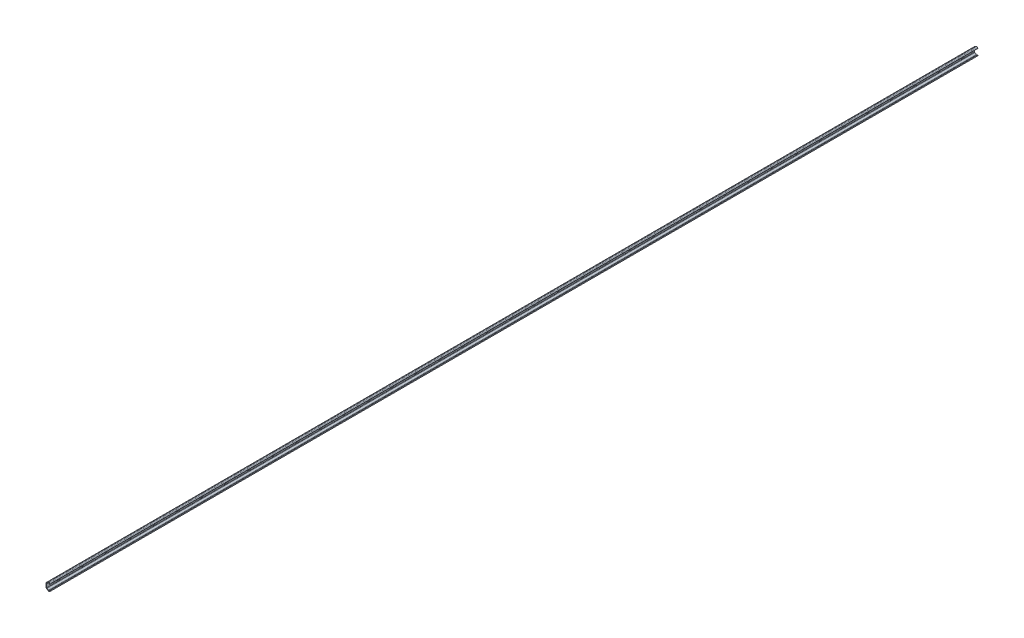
from build123d import *

# Parameters (mm, degrees)
BOSS_EXTRUDE1_DEPTH = 3120
CUT_EXTRUDE1_DEPTH  = 3121.048410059
LPATTERN1_COUNT     = 39
LPATTERN1_PITCH     = 80


with BuildPart() as part:
    # Sketch1 → Boss-Extrude1 (new body)
    with BuildSketch(Plane.XY):
        with BuildLine():
            Line((12.749875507, 8.887652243), (13.999952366, 11.052754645))
            Line((13.999952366, 11.052754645), (11.499977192, 12.496178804))
            ThreePointArc((11.499977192, 12.496178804), (9.499867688, 13.03212673), (7.499758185, 12.496178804))
            Line((7.499758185, 12.496178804), (1.999934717, 9.320716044))
            ThreePointArc((1.999934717, 9.320716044), (0.535879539, 7.85661948), (0, 5.856652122))
            Line((0, 5.856652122), (0, -5.856652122))
            ThreePointArc((0, -5.856652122), (0.535879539, -7.85661948), (1.999934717, -9.320716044))
            Line((1.999934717, -9.320716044), (7.499758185, -12.496178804))
            ThreePointArc((7.499758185, -12.496178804), (9.499867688, -13.03212673), (11.499977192, -12.496178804))
            Line((11.499977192, -12.496178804), (13.999952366, -11.052754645))
            Line((13.999952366, -11.052754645), (12.749875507, -8.887652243))
            Line((12.749875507, -8.887652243), (10.49990033, -10.186732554))
            ThreePointArc((10.49990033, -10.186732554), (9.499867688, -10.454700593), (8.499835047, -10.186732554))
            Line((8.499835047, -10.186732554), (3.500146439, -7.300035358))
            ThreePointArc((3.500146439, -7.300035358), (2.76811885, -6.567987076), (2.500179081, -5.568003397))
            Line((2.500179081, -5.568003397), (2.500179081, 0))
            Line((2.500179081, 0), (2.500179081, 5.568003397))
            ThreePointArc((2.500179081, 5.568003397), (2.76811885, 6.567987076), (3.500146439, 7.300035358))
            Line((3.500146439, 7.300035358), (8.499835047, 10.186732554))
            ThreePointArc((8.499835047, 10.186732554), (9.499867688, 10.454700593), (10.49990033, 10.186732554))
            Line((10.49990033, 10.186732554), (12.749875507, 8.887652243))
        make_face()
    extrude(amount=-BOSS_EXTRUDE1_DEPTH)

    # Sketch2 → Cut-Extrude1 (cut, through all)
    with BuildSketch(Plane(origin=(2.500179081, 0, 0), x_dir=(0, 0, -1), z_dir=(1, 0, 0))):
        with BuildLine():
            Line((37.5, 3), (42.5, 3))
            ThreePointArc((42.5, 3), (45.5, 0), (42.5, -3))
            Line((42.5, -3), (37.5, -3))
            ThreePointArc((37.5, -3), (34.5, 0), (37.5, 3))
        make_face()
    cut_extrude1 = extrude(amount=-CUT_EXTRUDE1_DEPTH, mode=Mode.SUBTRACT)

    # LPattern1: Cut-Extrude1 ×39
    with Locations(*[(0, 0, -i * LPATTERN1_PITCH) for i in range(1, LPATTERN1_COUNT)]):
        add(cut_extrude1, mode=Mode.SUBTRACT)


solid = part.part
